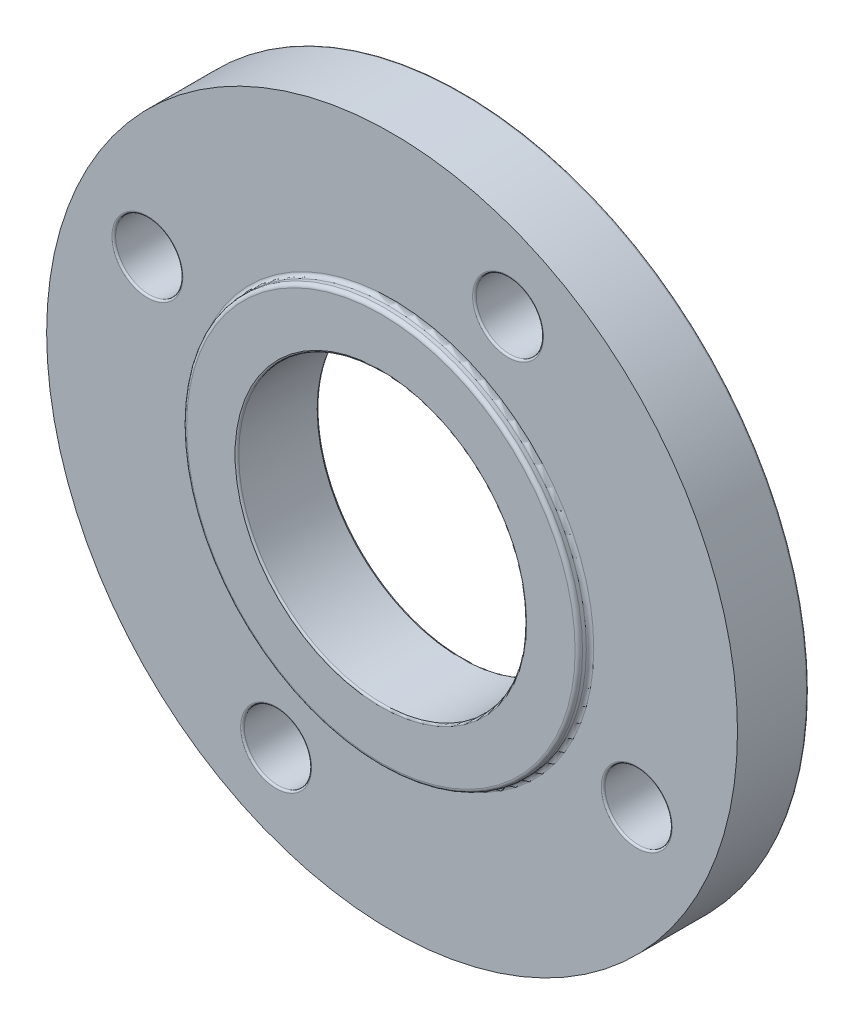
from build123d import *

# Parameters (mm, degrees)
ESQUISSE1_R      = 92.5
ESQUISSE1_R_2    = 38.55
EXTRUSION1_DEPTH = 22
CONG_1_R         = 0.5
ESQUISSE2_R      = 121.804642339
ESQUISSE2_R_2    = 53.012269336
EXTRUSION2_DEPTH = 3
CONG_2_R         = 1
ESQUISSE3_R      = 9
EXTRUSION3_DEPTH = 133.187367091
CONG_3_R         = 0.5


with BuildPart() as part:
    # Esquisse1 → Extrusion1 (new body)
    with BuildSketch(Plane.XY):
        Circle(ESQUISSE1_R)
        Circle(ESQUISSE1_R_2, mode=Mode.SUBTRACT)
    extrude(amount=EXTRUSION1_DEPTH)

    # Cong_1
    cong_1_edges = [part.edges().sort_by_distance(p)[0] for p in [
        (-92.5, 0, 0),
        (-92.5, 0, 22),
        (-38.55, 0, 0),
        (-38.55, 0, 22),
    ]]
    fillet(cong_1_edges, radius=CONG_1_R)

    # Esquisse2 → Extrusion2 (cut)
    with BuildSketch(Plane.XY.offset(22)):
        Circle(ESQUISSE2_R)
        Circle(ESQUISSE2_R_2, mode=Mode.SUBTRACT)
    extrude(amount=-EXTRUSION2_DEPTH, mode=Mode.SUBTRACT)

    # Cong_2
    cong_2_edges = [part.edges().sort_by_distance(p)[0] for p in [
        (-53.012269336, 0, 19),
        (-53.012269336, 0, 22),
    ]]
    fillet(cong_2_edges, radius=CONG_2_R)

    # Esquisse3 → Extrusion3 (cut, through all)
    with BuildSketch(Plane.XY.offset(19)):
        with Locations((65.51347918, -31.052118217)):
            Circle(ESQUISSE3_R)
        with Locations((-31.052118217, -65.51347918)):
            Circle(ESQUISSE3_R)
        with Locations((-65.51347918, 31.052118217)):
            Circle(ESQUISSE3_R)
        with Locations((31.052118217, 65.51347918)):
            Circle(ESQUISSE3_R)
    extrude(amount=-EXTRUSION3_DEPTH, mode=Mode.SUBTRACT)

    # Cong_3
    cong_3_edges = [part.edges().sort_by_distance(p)[0] for p in [
        (56.51347918, -31.052118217, 0),
        (56.51347918, -31.052118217, 19),
        (-40.052118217, -65.51347918, 0),
        (-40.052118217, -65.51347918, 19),
        (-74.51347918, 31.052118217, 0),
        (-74.51347918, 31.052118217, 19),
        (22.052118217, 65.51347918, 0),
        (22.052118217, 65.51347918, 19),
    ]]
    fillet(cong_3_edges, radius=CONG_3_R)


solid = part.part
